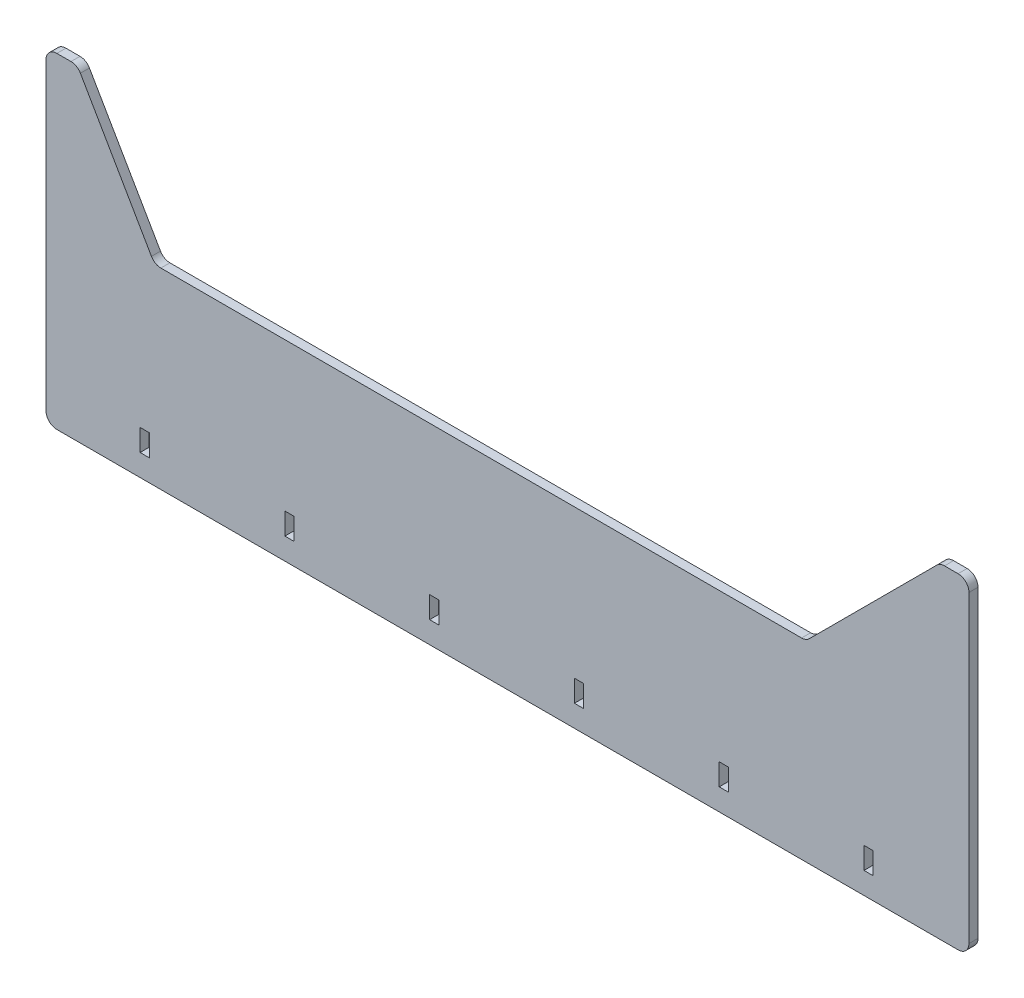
from build123d import *

# Parameters (mm, degrees)
SKETCH_1_W      = 2.53
SKETCH_1_H      = 6
EXTRUDE_4_DEPTH = 2.5
FILLET_1_R      = 3


with BuildPart() as part:
    # Sketch 1 → Extrude 4 (new body)
    with BuildSketch(Plane.XY):
        Polygon((-76.016483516, 7.835164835), (103.983516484, 7.835164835), (140.983516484, 44.835164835), (148.983516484, 44.835164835), (148.983516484, -45.164835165), (-106.016483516, -45.164835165), (-106.016483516, 44.835164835), (-97.378443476, 44.835164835), align=None)
        with Locations((-38.751483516, -36.164835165)):
            Rectangle(SKETCH_1_W, SKETCH_1_H, mode=Mode.SUBTRACT)
        with Locations((-78.751483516, -36.164835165)):
            Rectangle(SKETCH_1_W, SKETCH_1_H, mode=Mode.SUBTRACT)
        with Locations((1.248516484, -36.164835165)):
            Rectangle(SKETCH_1_W, SKETCH_1_H, mode=Mode.SUBTRACT)
        with Locations((41.248516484, -36.164835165)):
            Rectangle(SKETCH_1_W, SKETCH_1_H, mode=Mode.SUBTRACT)
        with Locations((81.248516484, -36.164835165)):
            Rectangle(SKETCH_1_W, SKETCH_1_H, mode=Mode.SUBTRACT)
        with Locations((121.248516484, -36.164835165)):
            Rectangle(SKETCH_1_W, SKETCH_1_H, mode=Mode.SUBTRACT)
    extrude(amount=EXTRUDE_4_DEPTH)

    # Fillet 1
    fillet_1_edges = [part.edges().sort_by_distance(p)[0] for p in [
        (-106.016483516, 44.835164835, 1.25),
        (-97.378443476, 44.835164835, 1.25),
        (-76.016483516, 7.835164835, 1.25),
        (103.983516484, 7.835164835, 1.25),
        (140.983516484, 44.835164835, 1.25),
        (148.983516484, 44.835164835, 1.25),
        (148.983516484, -45.164835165, 1.25),
        (-106.016483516, -45.164835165, 1.25),
    ]]
    fillet(fillet_1_edges, radius=FILLET_1_R)


solid = part.part
